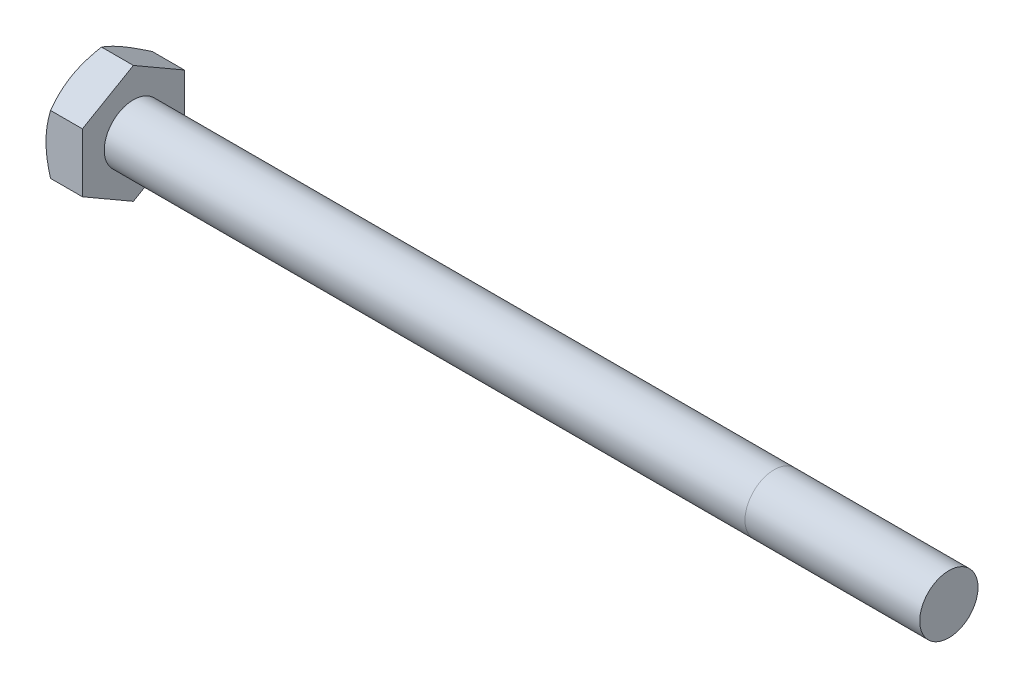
from build123d import *

# Parameters (mm, degrees)
SKETCH5_R           = 3.175
BOSS_EXTRUDE3_DEPTH = 88.9
BOSS_EXTRUDE4_DEPTH = 3.96875
SKETCH8_OUTSIDE_W   = 358.506
SKETCH8_OUTSIDE_H   = 360.226
SKETCH8_OUTSIDE_R   = 5.55625
CUT_EXTRUDE3_DEPTH  = 94.255772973
CUT_EXTRUDE3_DRAFT  = -60
CUT_EXTRUDE4_DEPTH  = 0.254
CIRPATTERN1_COUNT   = 3


with BuildPart() as part:
    # Sketch5 → Boss-Extrude3 (new body)
    with BuildSketch(Plane(origin=(46.434375, 0, 0), x_dir=(0, 0, -1), z_dir=(1, 0, 0))):
        Circle(SKETCH5_R)
    extrude(amount=-BOSS_EXTRUDE3_DEPTH)

    # Sketch11 → Revolve1 (revolve)
    with BuildSketch(Plane.XY):
        Polygon((-42.465625, 3.175), (-42.465625, 0), (30.559375, 0), (27.384375, 3.175), align=None)
    revolve(axis=Axis((-42.465625, 0, 0), (1, 0, 0)))

    # Sketch6 → Boss-Extrude4 (add)
    with BuildSketch(Plane.ZY.offset(42.465625)):
        Polygon((5.55625, 3.207902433), (0, 6.415804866), (-5.55625, 3.207902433), (-5.55625, -3.207902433), (0, -6.415804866), (5.55625, -3.207902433), align=None)
    extrude(amount=BOSS_EXTRUDE4_DEPTH)


with BuildPart() as cut_extrude3_tool:
    # Sketch8 outside → Cut-Extrude3 (with draft: the straight prism first)
    with BuildSketch(Plane.ZY.offset(46.434375)):
        Rectangle(SKETCH8_OUTSIDE_W, SKETCH8_OUTSIDE_H)
        Circle(SKETCH8_OUTSIDE_R, mode=Mode.SUBTRACT)
    extrude(amount=-CUT_EXTRUDE3_DEPTH)
    # Cut-Extrude3: the draft: its side faces are tilted about the plane it starts from
    cut_extrude3_sides = [cut_extrude3_tool.faces().sort_by_distance(p)[0] for p in [
        (0.693511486, -180.113, 0),
        (0.693511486, 0, 179.253),
        (0.693511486, 180.113, 0),
        (0.693511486, 0, -179.253),
        (0.693511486, 0, -5.55625),
    ]]
    draft(cut_extrude3_sides, Plane.ZY.offset(46.434375), CUT_EXTRUDE3_DRAFT)


with BuildPart() as part_1:
    add(part.part)

    # Cut-Extrude3: cut by cut_extrude3_tool
    add(cut_extrude3_tool.part, mode=Mode.SUBTRACT)

    # Sketch12 → Cut-Extrude4 (cut)
    with BuildSketch(Plane.ZY.offset(46.434375)):
        with BuildLine():
            Line((0.1666875, 4.2783125), (0.1666875, 2.3891875))
            ThreePointArc((0.1666875, 2.3891875), (0, 2.2225), (-0.1666875, 2.3891875))
            Line((-0.1666875, 2.3891875), (-0.1666875, 4.2783125))
            ThreePointArc((-0.1666875, 4.2783125), (0, 4.445), (0.1666875, 4.2783125))
        make_face()
    cut_extrude4 = extrude(amount=-CUT_EXTRUDE4_DEPTH, mode=Mode.SUBTRACT)

    # CirPattern1: Cut-Extrude4 ×3 about axis
    cirpattern1_axis = Axis((0, 0, 0), (1, 0, 0))
    for i in range(1, CIRPATTERN1_COUNT):
        add(cut_extrude4.rotate(cirpattern1_axis, i * 360 / CIRPATTERN1_COUNT), mode=Mode.SUBTRACT)


solid = part_1.part
